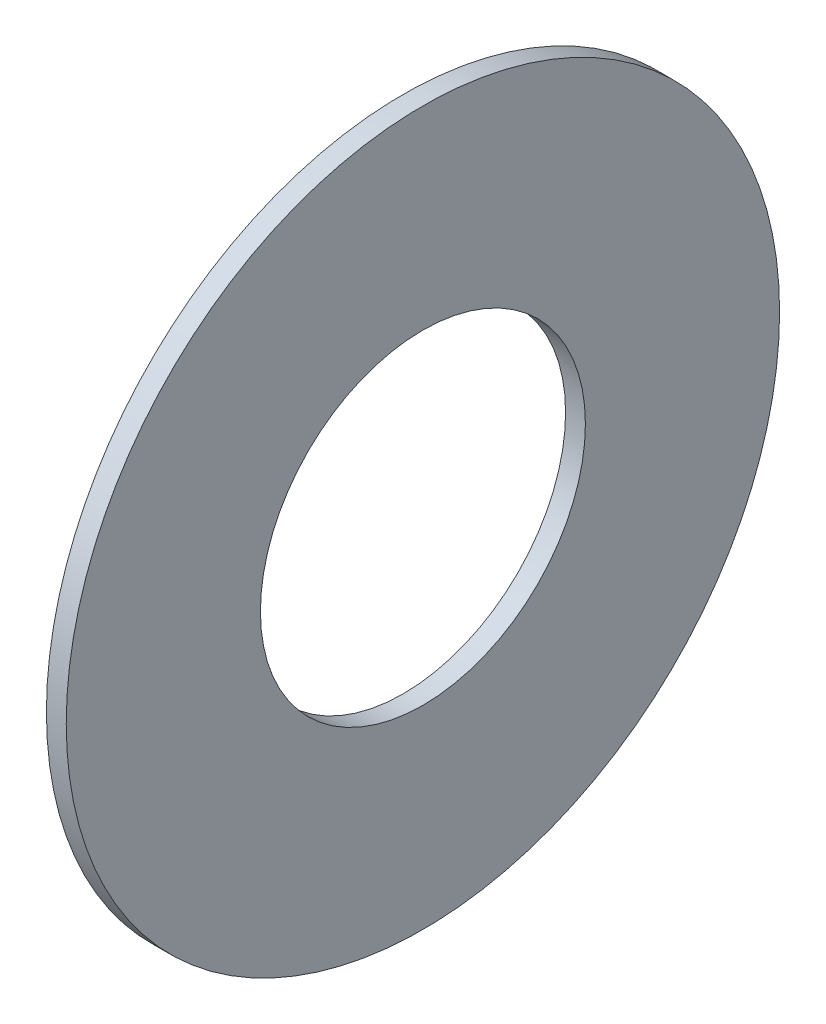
from build123d import *

# Parameters (mm, degrees)
ESQUISSE1_W = 0.5
ESQUISSE1_H = 4.9


with BuildPart() as part:
    # Esquisse1 → R_volution1 (revolve)
    with BuildSketch(Plane.XY, mode=Mode.PRIVATE) as r_volution1_sk:
        with Locations((0.25, 6.55)):
            Rectangle(ESQUISSE1_W, ESQUISSE1_H)
    revolve(r_volution1_sk.sketch.rotate(Axis((0, 0, 0), (1, 0, 0)), 270), axis=Axis((0, 0, 0), (1, 0, 0)))


solid = part.part
